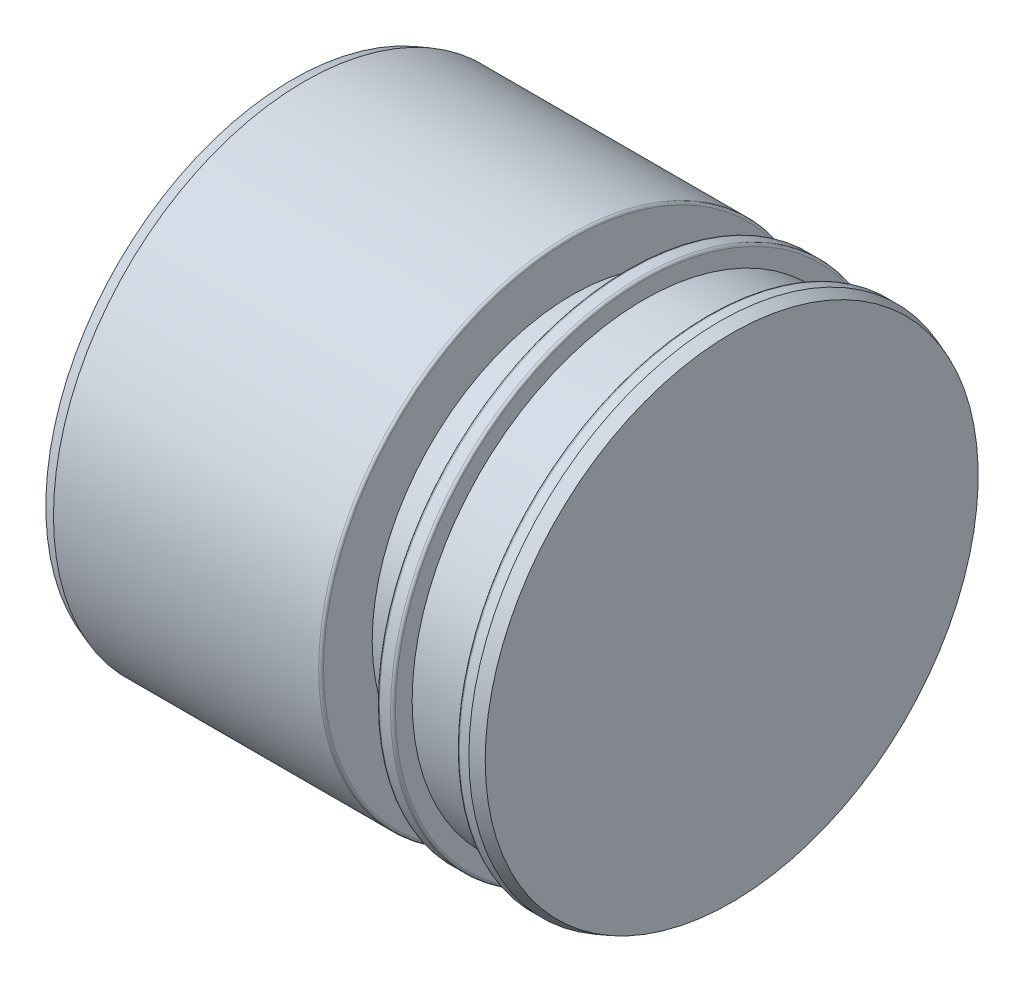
ISO-10303-21;
HEADER;
FILE_DESCRIPTION(('STEP AP214'),'2;1');
FILE_NAME('part.step','',(''),(''),'','','');
FILE_SCHEMA(('AUTOMOTIVE_DESIGN { 1 0 10303 214 1 1 1 1 }'));
ENDSEC;
DATA;
#1=APPLICATION_CONTEXT('core data for automotive mechanical design processes');
#2=APPLICATION_PROTOCOL_DEFINITION('international standard','automotive_design',2000,#1);
#3=PRODUCT_CONTEXT('',#1,'mechanical');
#4=PRODUCT('Part','Part','',(#3));
#5=PRODUCT_RELATED_PRODUCT_CATEGORY('part','',(#4));
#6=PRODUCT_DEFINITION_FORMATION('','',#4);
#7=PRODUCT_DEFINITION_CONTEXT('part definition',#1,'design');
#8=PRODUCT_DEFINITION('design','',#6,#7);
#9=PRODUCT_DEFINITION_SHAPE('','',#8);
#10=(LENGTH_UNIT() NAMED_UNIT(*) SI_UNIT(.MILLI.,.METRE.));
#11=(NAMED_UNIT(*) PLANE_ANGLE_UNIT() SI_UNIT($,.RADIAN.));
#12=(NAMED_UNIT(*) SI_UNIT($,.STERADIAN.) SOLID_ANGLE_UNIT());
#13=UNCERTAINTY_MEASURE_WITH_UNIT(LENGTH_MEASURE(1.E-05),#10,'distance_accuracy_value','');
#14=(GEOMETRIC_REPRESENTATION_CONTEXT(3) GLOBAL_UNCERTAINTY_ASSIGNED_CONTEXT((#13)) GLOBAL_UNIT_ASSIGNED_CONTEXT((#10,
#11,#12)) REPRESENTATION_CONTEXT('',''));
#15=CARTESIAN_POINT('',(0.,0.,0.));
#16=DIRECTION('',(0.,0.,1.));
#17=DIRECTION('',(1.,0.,0.));
#18=AXIS2_PLACEMENT_3D('',#15,#16,#17);
#19=CARTESIAN_POINT('',(0.,0.,0.));
#20=DIRECTION('',(1.,0.,0.));
#21=DIRECTION('',(0.,0.,-1.));
#22=AXIS2_PLACEMENT_3D('',#19,#20,#21);
#23=PLANE('',#22);
#24=CARTESIAN_POINT('',(0.,0.,0.));
#25=DIRECTION('',(1.,0.,0.));
#26=DIRECTION('',(0.,0.,-1.));
#27=AXIS2_PLACEMENT_3D('',#24,#25,#26);
#28=CIRCLE('',#27,30.8540446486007);
#29=CARTESIAN_POINT('',(0.,0.,-30.8540446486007));
#30=VERTEX_POINT('',#29);
#31=EDGE_CURVE('E68',#30,#30,#28,.F.);
#32=ORIENTED_EDGE('',*,*,#31,.T.);
#33=EDGE_LOOP('',(#32));
#34=FACE_BOUND('',#33,.T.);
#35=CARTESIAN_POINT('',(0.,0.,0.));
#36=DIRECTION('',(1.,0.,0.));
#37=DIRECTION('',(0.,1.,0.));
#38=AXIS2_PLACEMENT_3D('',#35,#36,#37);
#39=CIRCLE('',#38,20.);
#40=CARTESIAN_POINT('',(0.,20.,0.));
#41=VERTEX_POINT('',#40);
#42=EDGE_CURVE('E71',#41,#41,#39,.T.);
#43=ORIENTED_EDGE('',*,*,#42,.T.);
#44=EDGE_LOOP('',(#43));
#45=FACE_BOUND('',#44,.T.);
#46=ADVANCED_FACE('F31',(#34,#45),#23,.F.);
#47=CARTESIAN_POINT('',(0.,0.,0.));
#48=DIRECTION('',(-1.,0.,0.));
#49=DIRECTION('',(0.,0.,1.));
#50=AXIS2_PLACEMENT_3D('',#47,#48,#49);
#51=CYLINDRICAL_SURFACE('',#50,31.4);
#52=CARTESIAN_POINT('',(34.7,0.,0.));
#53=DIRECTION('',(-1.,0.,0.));
#54=DIRECTION('',(0.,0.,1.));
#55=AXIS2_PLACEMENT_3D('',#52,#53,#54);
#56=CIRCLE('',#55,31.4);
#57=CARTESIAN_POINT('',(34.7,0.,31.4));
#58=VERTEX_POINT('',#57);
#59=EDGE_CURVE('E37',#58,#58,#56,.T.);
#60=ORIENTED_EDGE('',*,*,#59,.T.);
#61=EDGE_LOOP('',(#60));
#62=FACE_BOUND('',#61,.T.);
#63=CARTESIAN_POINT('',(1.50000000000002,0.,0.));
#64=DIRECTION('',(1.,0.,0.));
#65=DIRECTION('',(0.,0.,-1.));
#66=AXIS2_PLACEMENT_3D('',#63,#64,#65);
#67=CIRCLE('',#66,31.4);
#68=CARTESIAN_POINT('',(1.50000000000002,0.,-31.4));
#69=VERTEX_POINT('',#68);
#70=EDGE_CURVE('E90',#69,#69,#67,.T.);
#71=ORIENTED_EDGE('',*,*,#70,.T.);
#72=EDGE_LOOP('',(#71));
#73=FACE_BOUND('',#72,.T.);
#74=ADVANCED_FACE('F58',(#62,#73),#51,.T.);
#75=CARTESIAN_POINT('',(35.,31.4,0.));
#76=DIRECTION('',(-1.,0.,0.));
#77=DIRECTION('',(0.,0.,1.));
#78=AXIS2_PLACEMENT_3D('',#75,#76,#77);
#79=PLANE('',#78);
#80=CARTESIAN_POINT('',(35.,0.,0.));
#81=DIRECTION('',(-1.,0.,0.));
#82=DIRECTION('',(0.,0.,1.));
#83=AXIS2_PLACEMENT_3D('',#80,#81,#82);
#84=CIRCLE('',#83,31.1);
#85=CARTESIAN_POINT('',(35.,0.,31.1));
#86=VERTEX_POINT('',#85);
#87=EDGE_CURVE('E11',#86,#86,#84,.F.);
#88=ORIENTED_EDGE('',*,*,#87,.T.);
#89=EDGE_LOOP('',(#88));
#90=FACE_BOUND('',#89,.T.);
#91=CARTESIAN_POINT('',(35.,0.,0.));
#92=DIRECTION('',(-1.,0.,0.));
#93=DIRECTION('',(0.,0.,1.));
#94=AXIS2_PLACEMENT_3D('',#91,#92,#93);
#95=CIRCLE('',#94,25.);
#96=CARTESIAN_POINT('',(35.,0.,25.));
#97=VERTEX_POINT('',#96);
#98=EDGE_CURVE('E86',#97,#97,#95,.T.);
#99=ORIENTED_EDGE('',*,*,#98,.T.);
#100=EDGE_LOOP('',(#99));
#101=FACE_BOUND('',#100,.T.);
#102=ADVANCED_FACE('F63',(#90,#101),#79,.F.);
#103=CARTESIAN_POINT('',(0.,0.,0.));
#104=DIRECTION('',(-1.,0.,0.));
#105=DIRECTION('',(0.,0.,1.));
#106=AXIS2_PLACEMENT_3D('',#103,#104,#105);
#107=CYLINDRICAL_SURFACE('',#106,25.);
#108=ORIENTED_EDGE('',*,*,#98,.F.);
#109=EDGE_LOOP('',(#108));
#110=FACE_BOUND('',#109,.T.);
#111=CARTESIAN_POINT('',(42.,0.,0.));
#112=DIRECTION('',(-1.,0.,0.));
#113=DIRECTION('',(0.,0.,1.));
#114=AXIS2_PLACEMENT_3D('',#111,#112,#113);
#115=CIRCLE('',#114,25.);
#116=CARTESIAN_POINT('',(42.,0.,25.));
#117=VERTEX_POINT('',#116);
#118=EDGE_CURVE('E83',#117,#117,#115,.T.);
#119=ORIENTED_EDGE('',*,*,#118,.T.);
#120=EDGE_LOOP('',(#119));
#121=FACE_BOUND('',#120,.T.);
#122=ADVANCED_FACE('F177',(#110,#121),#107,.T.);
#123=CARTESIAN_POINT('',(42.,25.,0.));
#124=DIRECTION('',(1.,0.,0.));
#125=DIRECTION('',(0.,0.,-1.));
#126=AXIS2_PLACEMENT_3D('',#123,#124,#125);
#127=PLANE('',#126);
#128=CARTESIAN_POINT('',(42.,0.,0.));
#129=DIRECTION('',(1.,0.,0.));
#130=DIRECTION('',(0.,0.,-1.));
#131=AXIS2_PLACEMENT_3D('',#128,#129,#130);
#132=CIRCLE('',#131,31.1);
#133=CARTESIAN_POINT('',(42.,0.,-31.1));
#134=VERTEX_POINT('',#133);
#135=EDGE_CURVE('E105',#134,#134,#132,.F.);
#136=ORIENTED_EDGE('',*,*,#135,.T.);
#137=EDGE_LOOP('',(#136));
#138=FACE_BOUND('',#137,.T.);
#139=ORIENTED_EDGE('',*,*,#118,.F.);
#140=EDGE_LOOP('',(#139));
#141=FACE_BOUND('',#140,.T.);
#142=ADVANCED_FACE('F173',(#138,#141),#127,.F.);
#143=CARTESIAN_POINT('',(0.,0.,0.));
#144=DIRECTION('',(-1.,0.,0.));
#145=DIRECTION('',(0.,0.,1.));
#146=AXIS2_PLACEMENT_3D('',#143,#144,#145);
#147=CYLINDRICAL_SURFACE('',#146,31.4);
#148=CARTESIAN_POINT('',(42.3,0.,0.));
#149=DIRECTION('',(1.,0.,0.));
#150=DIRECTION('',(0.,0.,-1.));
#151=AXIS2_PLACEMENT_3D('',#148,#149,#150);
#152=CIRCLE('',#151,31.4);
#153=CARTESIAN_POINT('',(42.3,0.,-31.4));
#154=VERTEX_POINT('',#153);
#155=EDGE_CURVE('E111',#154,#154,#152,.T.);
#156=ORIENTED_EDGE('',*,*,#155,.T.);
#157=EDGE_LOOP('',(#156));
#158=FACE_BOUND('',#157,.T.);
#159=CARTESIAN_POINT('',(43.7,0.,0.));
#160=DIRECTION('',(-1.,0.,0.));
#161=DIRECTION('',(0.,0.,1.));
#162=AXIS2_PLACEMENT_3D('',#159,#160,#161);
#163=CIRCLE('',#162,31.4);
#164=CARTESIAN_POINT('',(43.7,0.,31.4));
#165=VERTEX_POINT('',#164);
#166=EDGE_CURVE('E108',#165,#165,#163,.T.);
#167=ORIENTED_EDGE('',*,*,#166,.T.);
#168=EDGE_LOOP('',(#167));
#169=FACE_BOUND('',#168,.T.);
#170=ADVANCED_FACE('F169',(#158,#169),#147,.T.);
#171=CARTESIAN_POINT('',(44.,31.4,0.));
#172=DIRECTION('',(-1.,0.,0.));
#173=DIRECTION('',(0.,0.,1.));
#174=AXIS2_PLACEMENT_3D('',#171,#172,#173);
#175=PLANE('',#174);
#176=CARTESIAN_POINT('',(44.,0.,0.));
#177=DIRECTION('',(-1.,0.,0.));
#178=DIRECTION('',(0.,0.,1.));
#179=AXIS2_PLACEMENT_3D('',#176,#177,#178);
#180=CIRCLE('',#179,31.1);
#181=CARTESIAN_POINT('',(44.,0.,31.1));
#182=VERTEX_POINT('',#181);
#183=EDGE_CURVE('E114',#182,#182,#180,.F.);
#184=ORIENTED_EDGE('',*,*,#183,.T.);
#185=EDGE_LOOP('',(#184));
#186=FACE_BOUND('',#185,.T.);
#187=CARTESIAN_POINT('',(44.,0.,0.));
#188=DIRECTION('',(-1.,0.,0.));
#189=DIRECTION('',(0.,0.,1.));
#190=AXIS2_PLACEMENT_3D('',#187,#188,#189);
#191=CIRCLE('',#190,29.);
#192=CARTESIAN_POINT('',(44.,0.,29.));
#193=VERTEX_POINT('',#192);
#194=EDGE_CURVE('E76',#193,#193,#191,.T.);
#195=ORIENTED_EDGE('',*,*,#194,.T.);
#196=EDGE_LOOP('',(#195));
#197=FACE_BOUND('',#196,.T.);
#198=ADVANCED_FACE('F165',(#186,#197),#175,.F.);
#199=CARTESIAN_POINT('',(0.,0.,0.));
#200=DIRECTION('',(-1.,0.,0.));
#201=DIRECTION('',(0.,0.,1.));
#202=AXIS2_PLACEMENT_3D('',#199,#200,#201);
#203=CYLINDRICAL_SURFACE('',#202,29.);
#204=ORIENTED_EDGE('',*,*,#194,.F.);
#205=EDGE_LOOP('',(#204));
#206=FACE_BOUND('',#205,.T.);
#207=CARTESIAN_POINT('',(52.,0.,0.));
#208=DIRECTION('',(-1.,0.,0.));
#209=DIRECTION('',(0.,0.,1.));
#210=AXIS2_PLACEMENT_3D('',#207,#208,#209);
#211=CIRCLE('',#210,29.);
#212=CARTESIAN_POINT('',(52.,0.,29.));
#213=VERTEX_POINT('',#212);
#214=EDGE_CURVE('E72',#213,#213,#211,.T.);
#215=ORIENTED_EDGE('',*,*,#214,.T.);
#216=EDGE_LOOP('',(#215));
#217=FACE_BOUND('',#216,.T.);
#218=ADVANCED_FACE('F159',(#206,#217),#203,.T.);
#219=CARTESIAN_POINT('',(52.,29.,0.));
#220=DIRECTION('',(1.,0.,0.));
#221=DIRECTION('',(0.,0.,-1.));
#222=AXIS2_PLACEMENT_3D('',#219,#220,#221);
#223=PLANE('',#222);
#224=CARTESIAN_POINT('',(52.,0.,0.));
#225=DIRECTION('',(1.,0.,0.));
#226=DIRECTION('',(0.,0.,-1.));
#227=AXIS2_PLACEMENT_3D('',#224,#225,#226);
#228=CIRCLE('',#227,31.1);
#229=CARTESIAN_POINT('',(52.,0.,-31.1));
#230=VERTEX_POINT('',#229);
#231=EDGE_CURVE('E99',#230,#230,#228,.F.);
#232=ORIENTED_EDGE('',*,*,#231,.T.);
#233=EDGE_LOOP('',(#232));
#234=FACE_BOUND('',#233,.T.);
#235=ORIENTED_EDGE('',*,*,#214,.F.);
#236=EDGE_LOOP('',(#235));
#237=FACE_BOUND('',#236,.T.);
#238=ADVANCED_FACE('F150',(#234,#237),#223,.F.);
#239=CARTESIAN_POINT('',(0.,0.,0.));
#240=DIRECTION('',(-1.,0.,0.));
#241=DIRECTION('',(0.,0.,1.));
#242=AXIS2_PLACEMENT_3D('',#239,#240,#241);
#243=CYLINDRICAL_SURFACE('',#242,31.4);
#244=CARTESIAN_POINT('',(52.3,0.,0.));
#245=DIRECTION('',(1.,0.,0.));
#246=DIRECTION('',(0.,0.,-1.));
#247=AXIS2_PLACEMENT_3D('',#244,#245,#246);
#248=CIRCLE('',#247,31.4);
#249=CARTESIAN_POINT('',(52.3,0.,-31.4));
#250=VERTEX_POINT('',#249);
#251=EDGE_CURVE('E102',#250,#250,#248,.T.);
#252=ORIENTED_EDGE('',*,*,#251,.T.);
#253=EDGE_LOOP('',(#252));
#254=FACE_BOUND('',#253,.T.);
#255=CARTESIAN_POINT('',(53.4999999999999,0.,0.));
#256=DIRECTION('',(-1.,0.,0.));
#257=DIRECTION('',(0.,0.,1.));
#258=AXIS2_PLACEMENT_3D('',#255,#256,#257);
#259=CIRCLE('',#258,31.4);
#260=CARTESIAN_POINT('',(53.4999999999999,0.,31.4));
#261=VERTEX_POINT('',#260);
#262=EDGE_CURVE('E93',#261,#261,#259,.T.);
#263=ORIENTED_EDGE('',*,*,#262,.T.);
#264=EDGE_LOOP('',(#263));
#265=FACE_BOUND('',#264,.T.);
#266=ADVANCED_FACE('F148',(#254,#265),#243,.T.);
#267=CARTESIAN_POINT('',(55.,31.4,0.));
#268=DIRECTION('',(-1.,0.,0.));
#269=DIRECTION('',(0.,0.,1.));
#270=AXIS2_PLACEMENT_3D('',#267,#268,#269);
#271=PLANE('',#270);
#272=CARTESIAN_POINT('',(55.,0.,0.));
#273=DIRECTION('',(-1.,0.,0.));
#274=DIRECTION('',(0.,0.,1.));
#275=AXIS2_PLACEMENT_3D('',#272,#273,#274);
#276=CIRCLE('',#275,30.8540446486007);
#277=CARTESIAN_POINT('',(55.,0.,30.8540446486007));
#278=VERTEX_POINT('',#277);
#279=EDGE_CURVE('E96',#278,#278,#276,.F.);
#280=ORIENTED_EDGE('',*,*,#279,.T.);
#281=EDGE_LOOP('',(#280));
#282=FACE_BOUND('',#281,.T.);
#283=ADVANCED_FACE('F53',(#282),#271,.F.);
#284=CARTESIAN_POINT('',(45.,0.,0.));
#285=DIRECTION('',(1.,0.,0.));
#286=DIRECTION('',(0.,1.,0.));
#287=AXIS2_PLACEMENT_3D('',#284,#285,#286);
#288=CYLINDRICAL_SURFACE('',#287,20.);
#289=ORIENTED_EDGE('',*,*,#42,.F.);
#290=EDGE_LOOP('',(#289));
#291=FACE_BOUND('',#290,.T.);
#292=CARTESIAN_POINT('',(33.4529946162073,0.,0.));
#293=DIRECTION('',(1.,0.,0.));
#294=DIRECTION('',(0.,1.,0.));
#295=AXIS2_PLACEMENT_3D('',#292,#293,#294);
#296=CIRCLE('',#295,20.);
#297=CARTESIAN_POINT('',(33.4529946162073,20.,0.));
#298=VERTEX_POINT('',#297);
#299=EDGE_CURVE('E73',#298,#298,#296,.T.);
#300=ORIENTED_EDGE('',*,*,#299,.T.);
#301=EDGE_LOOP('',(#300));
#302=FACE_BOUND('',#301,.T.);
#303=ADVANCED_FACE('F43',(#291,#302),#288,.F.);
#304=CARTESIAN_POINT('',(45.,0.,0.));
#305=DIRECTION('',(-1.,0.,0.));
#306=DIRECTION('',(0.,-1.,0.));
#307=AXIS2_PLACEMENT_3D('',#304,#305,#306);
#308=CONICAL_SURFACE('',#307,0.,1.04719755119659);
#309=ORIENTED_EDGE('',*,*,#299,.F.);
#310=EDGE_LOOP('',(#309));
#311=FACE_BOUND('',#310,.T.);
#312=CARTESIAN_POINT('',(45.,0.,0.));
#313=VERTEX_POINT('',#312);
#314=VERTEX_LOOP('',#313);
#315=FACE_BOUND('',#314,.T.);
#316=ADVANCED_FACE('F40',(#311,#315),#308,.F.);
#317=CARTESIAN_POINT('',(0.,0.,0.));
#318=DIRECTION('',(1.,0.,0.));
#319=DIRECTION('',(0.,0.,-1.));
#320=AXIS2_PLACEMENT_3D('',#317,#318,#319);
#321=CONICAL_SURFACE('',#320,30.8540446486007,0.34906585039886);
#322=ORIENTED_EDGE('',*,*,#70,.F.);
#323=EDGE_LOOP('',(#322));
#324=FACE_BOUND('',#323,.T.);
#325=ORIENTED_EDGE('',*,*,#31,.F.);
#326=EDGE_LOOP('',(#325));
#327=FACE_BOUND('',#326,.T.);
#328=ADVANCED_FACE('F42',(#324,#327),#321,.T.);
#329=CARTESIAN_POINT('',(53.4999999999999,0.,0.));
#330=DIRECTION('',(-1.,0.,0.));
#331=DIRECTION('',(0.,0.,1.));
#332=AXIS2_PLACEMENT_3D('',#329,#330,#331);
#333=CONICAL_SURFACE('',#332,31.4,0.349065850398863);
#334=ORIENTED_EDGE('',*,*,#279,.F.);
#335=EDGE_LOOP('',(#334));
#336=FACE_BOUND('',#335,.T.);
#337=ORIENTED_EDGE('',*,*,#262,.F.);
#338=EDGE_LOOP('',(#337));
#339=FACE_BOUND('',#338,.T.);
#340=ADVANCED_FACE('F50',(#336,#339),#333,.T.);
#341=CARTESIAN_POINT('',(52.3,0.,0.));
#342=DIRECTION('',(1.,0.,0.));
#343=DIRECTION('',(0.,0.,-1.));
#344=AXIS2_PLACEMENT_3D('',#341,#342,#343);
#345=TOROIDAL_SURFACE('',#344,31.1,0.3);
#346=ORIENTED_EDGE('',*,*,#251,.F.);
#347=EDGE_LOOP('',(#346));
#348=FACE_BOUND('',#347,.T.);
#349=ORIENTED_EDGE('',*,*,#231,.F.);
#350=EDGE_LOOP('',(#349));
#351=FACE_BOUND('',#350,.T.);
#352=ADVANCED_FACE('F135',(#348,#351),#345,.T.);
#353=CARTESIAN_POINT('',(42.3,0.,0.));
#354=DIRECTION('',(1.,0.,0.));
#355=DIRECTION('',(0.,0.,-1.));
#356=AXIS2_PLACEMENT_3D('',#353,#354,#355);
#357=TOROIDAL_SURFACE('',#356,31.1,0.3);
#358=ORIENTED_EDGE('',*,*,#155,.F.);
#359=EDGE_LOOP('',(#358));
#360=FACE_BOUND('',#359,.T.);
#361=ORIENTED_EDGE('',*,*,#135,.F.);
#362=EDGE_LOOP('',(#361));
#363=FACE_BOUND('',#362,.T.);
#364=ADVANCED_FACE('F128',(#360,#363),#357,.T.);
#365=CARTESIAN_POINT('',(43.7,0.,0.));
#366=DIRECTION('',(-1.,0.,0.));
#367=DIRECTION('',(0.,0.,1.));
#368=AXIS2_PLACEMENT_3D('',#365,#366,#367);
#369=TOROIDAL_SURFACE('',#368,31.1,0.3);
#370=ORIENTED_EDGE('',*,*,#183,.F.);
#371=EDGE_LOOP('',(#370));
#372=FACE_BOUND('',#371,.T.);
#373=ORIENTED_EDGE('',*,*,#166,.F.);
#374=EDGE_LOOP('',(#373));
#375=FACE_BOUND('',#374,.T.);
#376=ADVANCED_FACE('F122',(#372,#375),#369,.T.);
#377=CARTESIAN_POINT('',(34.7,0.,0.));
#378=DIRECTION('',(-1.,0.,0.));
#379=DIRECTION('',(0.,0.,1.));
#380=AXIS2_PLACEMENT_3D('',#377,#378,#379);
#381=TOROIDAL_SURFACE('',#380,31.1,0.3);
#382=ORIENTED_EDGE('',*,*,#87,.F.);
#383=EDGE_LOOP('',(#382));
#384=FACE_BOUND('',#383,.T.);
#385=ORIENTED_EDGE('',*,*,#59,.F.);
#386=EDGE_LOOP('',(#385));
#387=FACE_BOUND('',#386,.T.);
#388=ADVANCED_FACE('F120',(#384,#387),#381,.T.);
#389=CLOSED_SHELL('',(#46,#74,#102,#122,#142,#170,#198,#218,#238,#266,#283,#303,#316,#328,#340,
#352,#364,#376,#388));
#390=MANIFOLD_SOLID_BREP('B2',#389);
#391=ADVANCED_BREP_SHAPE_REPRESENTATION('',(#18,#390),#14);
#392=SHAPE_DEFINITION_REPRESENTATION(#9,#391);
ENDSEC;
END-ISO-10303-21;
